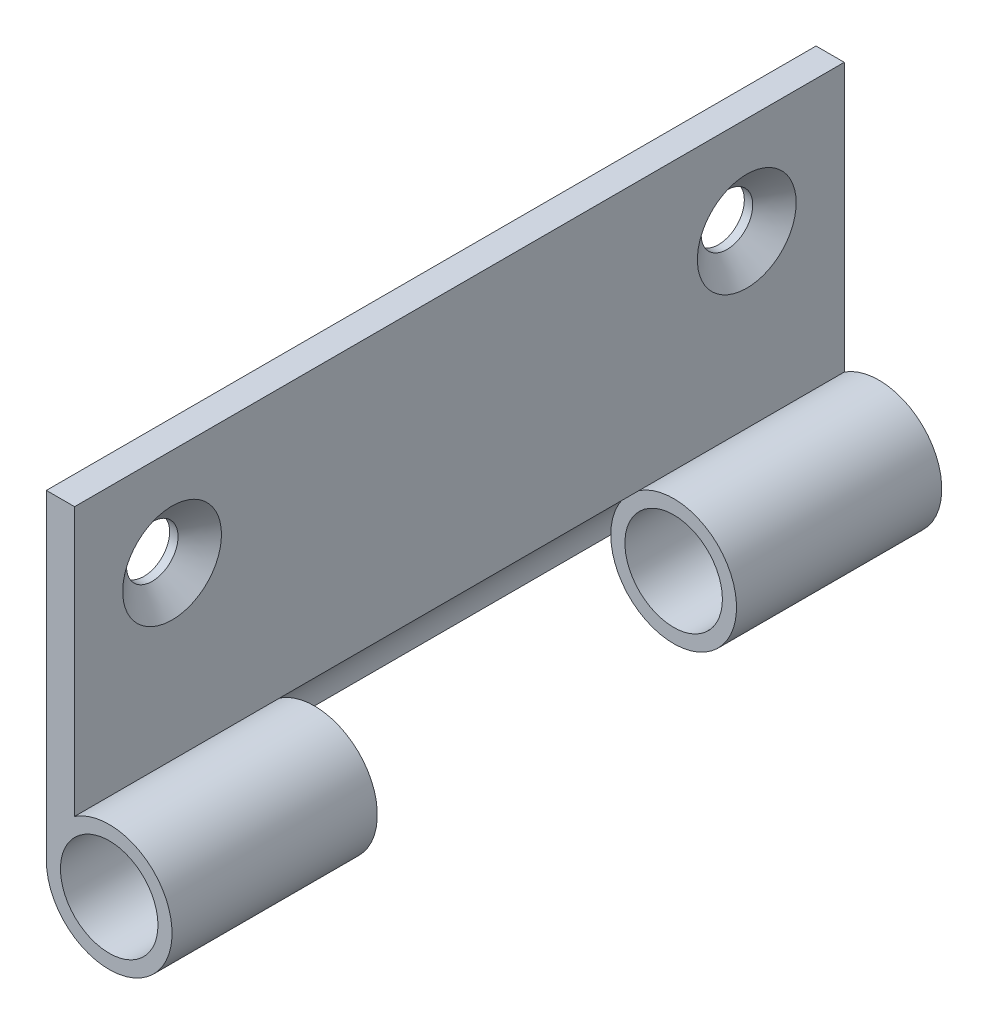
from build123d import *

# Parameters (mm, degrees)
SKETCH1_W                                  = 76.2
SKETCH1_H                                  = 31.75
BOSS_EXTRUDE1_DEPTH                        = 2.794
SKETCH2_R                                  = 6.223
BOSS_EXTRUDE2_DEPTH                        = 76.2
SKETCH3_R                                  = 4.826
CUT_EXTRUDE1_DEPTH                         = 84.482964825
SKETCH4_R                                  = 6.223
CUT_EXTRUDE2_DEPTH                         = 17.78
CSK_FOR_10_FLAT_HEAD_MACHINE_SCREW_2_COUNT = 2
CSK_FOR_10_FLAT_HEAD_MACHINE_SCREW_2_PITCH = 56.896


with BuildPart() as part:
    # Sketch1 → Boss-Extrude1 (new body)
    with BuildSketch(Plane(origin=(0, 0, 0), x_dir=(0, 0, -1), z_dir=(1, 0, 0))):
        with Locations((0, 15.875)):
            Rectangle(SKETCH1_W, SKETCH1_H)
    extrude(amount=BOSS_EXTRUDE1_DEPTH)

    # Sketch2 → Boss-Extrude2 (add)
    with BuildSketch(Plane.XY.offset(38.1)):
        with Locations((6.223, 0)):
            Circle(SKETCH2_R)
    extrude(amount=-BOSS_EXTRUDE2_DEPTH)

    # Sketch3 → Cut-Extrude1 (cut, through all)
    with BuildSketch(Plane.XY.offset(38.1)):
        with Locations((6.223, 0)):
            Circle(SKETCH3_R)
    extrude(amount=-CUT_EXTRUDE1_DEPTH, mode=Mode.SUBTRACT)

    # Sketch4 → Cut-Extrude2 (cut, symmetric)
    with BuildSketch(Plane.XY):
        with Locations((6.223, 0)):
            Circle(SKETCH4_R)
    extrude(amount=CUT_EXTRUDE2_DEPTH, both=True, mode=Mode.SUBTRACT)

    # Sketch7 → CSK for _10 Flat Head Machine Screw _100 (revolve, cut)
    with BuildSketch(Plane(origin=(2.794, 22.098, -28.448), x_dir=(0, 0, -1), z_dir=(0, 1, 0))):
        Polygon((0, 0), (0, 2.794), (2.5527, 2.794), (2.5527, 1.960808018), (4.8895, 0), align=None)
    csk_for_10_flat_head_machine_screw_100 = revolve(axis=Axis((9.144, 22.098, -28.448), (-1, 0, 0)), mode=Mode.SUBTRACT)

    # CSK for _10 Flat Head Machine Screw  2: CSK for _10 Flat Head Machine Screw _100 ×2
    with Locations(*[(0, 0, i * CSK_FOR_10_FLAT_HEAD_MACHINE_SCREW_2_PITCH) for i in range(1, CSK_FOR_10_FLAT_HEAD_MACHINE_SCREW_2_COUNT)]):
        add(csk_for_10_flat_head_machine_screw_100, mode=Mode.SUBTRACT)


solid = part.part
